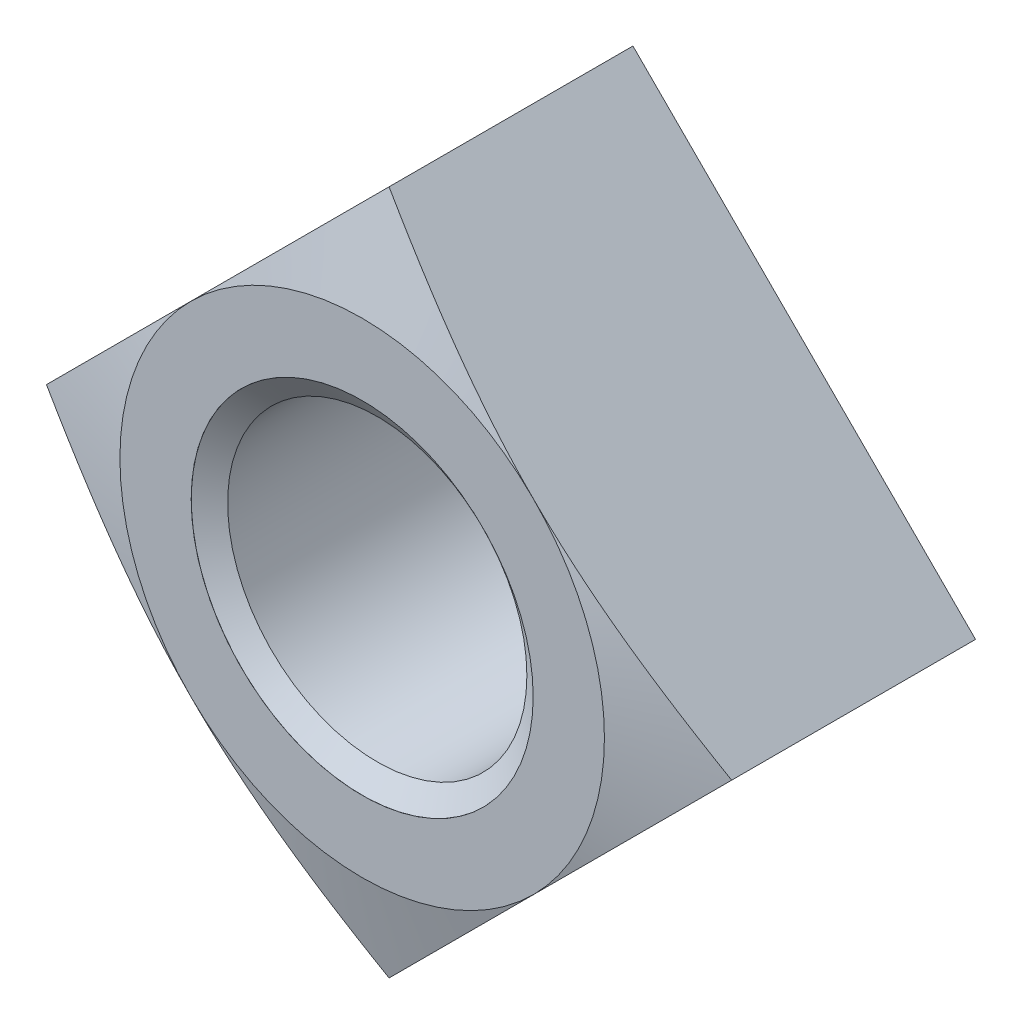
ISO-10303-21;
HEADER;
FILE_DESCRIPTION(('STEP AP214'),'2;1');
FILE_NAME('part.step','',(''),(''),'','','');
FILE_SCHEMA(('AUTOMOTIVE_DESIGN { 1 0 10303 214 1 1 1 1 }'));
ENDSEC;
DATA;
#1=APPLICATION_CONTEXT('core data for automotive mechanical design processes');
#2=APPLICATION_PROTOCOL_DEFINITION('international standard','automotive_design',2000,#1);
#3=PRODUCT_CONTEXT('',#1,'mechanical');
#4=PRODUCT('Part','Part','',(#3));
#5=PRODUCT_RELATED_PRODUCT_CATEGORY('part','',(#4));
#6=PRODUCT_DEFINITION_FORMATION('','',#4);
#7=PRODUCT_DEFINITION_CONTEXT('part definition',#1,'design');
#8=PRODUCT_DEFINITION('design','',#6,#7);
#9=PRODUCT_DEFINITION_SHAPE('','',#8);
#10=(LENGTH_UNIT() NAMED_UNIT(*) SI_UNIT(.MILLI.,.METRE.));
#11=(NAMED_UNIT(*) PLANE_ANGLE_UNIT() SI_UNIT($,.RADIAN.));
#12=(NAMED_UNIT(*) SI_UNIT($,.STERADIAN.) SOLID_ANGLE_UNIT());
#13=UNCERTAINTY_MEASURE_WITH_UNIT(LENGTH_MEASURE(1.E-05),#10,'distance_accuracy_value','');
#14=(GEOMETRIC_REPRESENTATION_CONTEXT(3) GLOBAL_UNCERTAINTY_ASSIGNED_CONTEXT((#13)) GLOBAL_UNIT_ASSIGNED_CONTEXT((#10,
#11,#12)) REPRESENTATION_CONTEXT('',''));
#15=CARTESIAN_POINT('',(0.,0.,0.));
#16=DIRECTION('',(0.,0.,1.));
#17=DIRECTION('',(1.,0.,0.));
#18=AXIS2_PLACEMENT_3D('',#15,#16,#17);
#19=CARTESIAN_POINT('',(0.,0.,-19.));
#20=DIRECTION('',(0.,0.,1.));
#21=DIRECTION('',(1.,0.,0.));
#22=AXIS2_PLACEMENT_3D('',#19,#20,#21);
#23=CYLINDRICAL_SURFACE('',#22,10.5);
#24=CARTESIAN_POINT('',(0.,0.,-1.05831130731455));
#25=DIRECTION('',(0.,0.,1.));
#26=DIRECTION('',(1.,0.,0.));
#27=AXIS2_PLACEMENT_3D('',#24,#25,#26);
#28=CIRCLE('',#27,10.5);
#29=CARTESIAN_POINT('',(10.5,0.,-1.05831130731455));
#30=VERTEX_POINT('',#29);
#31=EDGE_CURVE('E185',#30,#30,#28,.F.);
#32=ORIENTED_EDGE('',*,*,#31,.F.);
#33=EDGE_LOOP('',(#32));
#34=FACE_BOUND('',#33,.T.);
#35=CARTESIAN_POINT('',(0.,0.,-17.9406886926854));
#36=DIRECTION('',(0.,0.,-1.));
#37=DIRECTION('',(-1.,0.,0.));
#38=AXIS2_PLACEMENT_3D('',#35,#36,#37);
#39=CIRCLE('',#38,10.5);
#40=CARTESIAN_POINT('',(-10.5,0.,-17.9406886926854));
#41=VERTEX_POINT('',#40);
#42=EDGE_CURVE('E46',#41,#41,#39,.F.);
#43=ORIENTED_EDGE('',*,*,#42,.F.);
#44=EDGE_LOOP('',(#43));
#45=FACE_BOUND('',#44,.T.);
#46=ADVANCED_FACE('F41',(#34,#45),#23,.F.);
#47=CARTESIAN_POINT('',(0.,-24.0416305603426,-19.));
#48=DIRECTION('',(0.707106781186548,-0.707106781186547,0.));
#49=DIRECTION('',(0.707106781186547,0.707106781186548,0.));
#50=AXIS2_PLACEMENT_3D('',#47,#48,#49);
#51=PLANE('',#50);
#52=DIRECTION('',(0.,0.,1.));
#53=VECTOR('',#52,1.);
#54=CARTESIAN_POINT('',(24.0416305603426,0.,-19.));
#55=LINE('',#54,#53);
#56=CARTESIAN_POINT('',(24.0416305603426,0.,-19.));
#57=VERTEX_POINT('',#56);
#58=CARTESIAN_POINT('',(24.0416305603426,0.,-1.88679922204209));
#59=VERTEX_POINT('',#58);
#60=EDGE_CURVE('E172',#57,#59,#55,.T.);
#61=ORIENTED_EDGE('',*,*,#60,.T.);
#62=CARTESIAN_POINT('',(24.0418305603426,0.000200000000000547,-1.88685281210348));
#63=CARTESIAN_POINT('',(23.6810411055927,-0.360589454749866,-1.7901955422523));
#64=CARTESIAN_POINT('',(23.3199703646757,-0.721660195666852,-1.69560617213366));
#65=CARTESIAN_POINT('',(22.5971946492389,-1.44443591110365,-1.51127094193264));
#66=CARTESIAN_POINT('',(22.2354896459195,-1.80614091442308,-1.42152530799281));
#67=CARTESIAN_POINT('',(21.5111693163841,-2.5304612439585,-1.24753722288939));
#68=CARTESIAN_POINT('',(21.1485535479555,-2.89307701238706,-1.16329842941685));
#69=CARTESIAN_POINT('',(20.4226152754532,-3.61901528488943,-1.00123125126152));
#70=CARTESIAN_POINT('',(20.059292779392,-3.98233778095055,-0.92340279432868));
#71=CARTESIAN_POINT('',(18.9673670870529,-5.07426347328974,-0.700735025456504));
#72=CARTESIAN_POINT('',(18.2375962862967,-5.80403427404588,-0.566907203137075));
#73=CARTESIAN_POINT('',(17.1408011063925,-6.90082945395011,-0.394369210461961));
#74=CARTESIAN_POINT('',(16.7748732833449,-7.26675727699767,-0.341560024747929));
#75=CARTESIAN_POINT('',(16.0423433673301,-7.99928719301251,-0.24638041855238));
#76=CARTESIAN_POINT('',(15.6757412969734,-8.3658892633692,-0.204009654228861));
#77=CARTESIAN_POINT('',(14.9475096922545,-9.09412086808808,-0.131203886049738));
#78=CARTESIAN_POINT('',(14.5858887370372,-9.45574182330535,-0.100598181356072));
#79=CARTESIAN_POINT('',(13.8622417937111,-10.1793887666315,-0.0511623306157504));
#80=CARTESIAN_POINT('',(13.5002158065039,-10.5414147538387,-0.0323321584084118));
#81=CARTESIAN_POINT('',(12.7759417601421,-11.2656888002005,-0.00693322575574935));
#82=CARTESIAN_POINT('',(12.4136936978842,-11.6279368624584,-0.00036464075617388));
#83=CARTESIAN_POINT('',(11.68919235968,-12.3524382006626,0.000335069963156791));
#84=CARTESIAN_POINT('',(11.3269390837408,-12.7146914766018,-0.00553378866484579));
#85=CARTESIAN_POINT('',(10.6030026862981,-13.4386278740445,-0.0295412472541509));
#86=CARTESIAN_POINT('',(10.2413193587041,-13.8003112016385,-0.047667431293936));
#87=CARTESIAN_POINT('',(9.51835087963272,-14.5232796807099,-0.0957014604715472));
#88=CARTESIAN_POINT('',(9.15706573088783,-14.8845648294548,-0.12560938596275));
#89=CARTESIAN_POINT('',(8.07403908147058,-15.967591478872,-0.231960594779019));
#90=CARTESIAN_POINT('',(7.35308599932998,-16.6885445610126,-0.325032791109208));
#91=CARTESIAN_POINT('',(6.35641213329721,-17.6852184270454,-0.479473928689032));
#92=CARTESIAN_POINT('',(6.07939888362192,-17.9622316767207,-0.525167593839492));
#93=CARTESIAN_POINT('',(5.52582325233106,-18.5158073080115,-0.621550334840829));
#94=CARTESIAN_POINT('',(5.24926083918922,-18.7923697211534,-0.672239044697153));
#95=CARTESIAN_POINT('',(4.42016185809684,-19.6214687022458,-0.831140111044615));
#96=CARTESIAN_POINT('',(3.8682783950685,-20.1733521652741,-0.94617714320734));
#97=CARTESIAN_POINT('',(2.76265174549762,-21.278978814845,-1.19188048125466));
#98=CARTESIAN_POINT('',(2.20891926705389,-21.8327112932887,-1.32264211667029));
#99=CARTESIAN_POINT('',(1.37955839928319,-22.6620721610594,-1.52787262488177));
#100=CARTESIAN_POINT('',(1.1033603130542,-22.9382702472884,-1.59778417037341));
#101=CARTESIAN_POINT('',(0.551320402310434,-23.4903101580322,-1.74034210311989));
#102=CARTESIAN_POINT('',(0.275478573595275,-23.7661519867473,-1.81298845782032));
#103=CARTESIAN_POINT('',(-0.000200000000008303,-24.0418305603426,-1.88685281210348));
#104=B_SPLINE_CURVE_WITH_KNOTS('',3,(#62,#63,#64,#65,#66,#67,#68,#69,#70,#71,#72,#73,#74,#75,
#76,#77,#78,#79,#80,#81,#82,#83,#84,#85,#86,#87,#88,#89,#90,#91,#92,#93,#94,#95,#96,#97,#98,#99,
#100,#101,#102,#103),.UNSPECIFIED.,.F.,.F.,(4,2,2,2,2,2,2,2,2,2,2,2,2,2,2,2,2,2,2,2,4),(0.,
1.55792765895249,3.11592799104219,4.67495286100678,6.23396015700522,9.35537810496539,
10.9158569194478,12.4762843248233,14.0131299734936,15.5499722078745,17.0868364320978,
18.6236987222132,20.159006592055,21.6943249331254,24.7647903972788,25.948012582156,
27.1311481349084,29.4976960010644,31.8793921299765,33.0698149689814,34.2602236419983),.UNSPECIFIED.);
#105=CARTESIAN_POINT('',(12.0208152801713,-12.0208152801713,0.));
#106=VERTEX_POINT('',#105);
#107=EDGE_CURVE('E162',#59,#106,#104,.T.);
#108=ORIENTED_EDGE('',*,*,#107,.T.);
#109=CARTESIAN_POINT('',(0.,-24.0416305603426,-1.88679922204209));
#110=VERTEX_POINT('',#109);
#111=EDGE_CURVE('E69',#106,#110,#104,.T.);
#112=ORIENTED_EDGE('',*,*,#111,.T.);
#113=DIRECTION('',(0.,0.,1.));
#114=VECTOR('',#113,1.);
#115=CARTESIAN_POINT('',(0.,-24.0416305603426,-19.));
#116=LINE('',#115,#114);
#117=CARTESIAN_POINT('',(0.,-24.0416305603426,-19.));
#118=VERTEX_POINT('',#117);
#119=EDGE_CURVE('E117',#118,#110,#116,.T.);
#120=ORIENTED_EDGE('',*,*,#119,.F.);
#121=DIRECTION('',(0.707106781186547,0.707106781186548,0.));
#122=VECTOR('',#121,1.);
#123=CARTESIAN_POINT('',(0.,-24.0416305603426,-19.));
#124=LINE('',#123,#122);
#125=EDGE_CURVE('E161',#118,#57,#124,.T.);
#126=ORIENTED_EDGE('',*,*,#125,.T.);
#127=EDGE_LOOP('',(#61,#108,#112,#120,#126));
#128=FACE_BOUND('',#127,.T.);
#129=ADVANCED_FACE('F43',(#128),#51,.T.);
#130=CARTESIAN_POINT('',(-24.0416305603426,0.,-19.));
#131=DIRECTION('',(-0.707106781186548,-0.707106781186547,0.));
#132=DIRECTION('',(0.707106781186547,-0.707106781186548,0.));
#133=AXIS2_PLACEMENT_3D('',#130,#131,#132);
#134=PLANE('',#133);
#135=ORIENTED_EDGE('',*,*,#119,.T.);
#136=CARTESIAN_POINT('',(0.00019999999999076,-24.0418305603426,-1.88685281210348));
#137=CARTESIAN_POINT('',(-0.360589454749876,-23.6810411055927,-1.79019554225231));
#138=CARTESIAN_POINT('',(-0.721660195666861,-23.3199703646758,-1.69560617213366));
#139=CARTESIAN_POINT('',(-1.44443591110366,-22.597194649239,-1.51127094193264));
#140=CARTESIAN_POINT('',(-1.80614091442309,-22.2354896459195,-1.42152530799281));
#141=CARTESIAN_POINT('',(-2.53046124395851,-21.5111693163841,-1.24753722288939));
#142=CARTESIAN_POINT('',(-2.89307701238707,-21.1485535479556,-1.16329842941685));
#143=CARTESIAN_POINT('',(-3.61901528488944,-20.4226152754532,-1.00123125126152));
#144=CARTESIAN_POINT('',(-3.98233778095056,-20.0592927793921,-0.923402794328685));
#145=CARTESIAN_POINT('',(-5.07426347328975,-18.9673670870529,-0.700735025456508));
#146=CARTESIAN_POINT('',(-5.80403427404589,-18.2375962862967,-0.566907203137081));
#147=CARTESIAN_POINT('',(-6.90082945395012,-17.1408011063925,-0.394369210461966));
#148=CARTESIAN_POINT('',(-7.26675727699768,-16.7748732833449,-0.341560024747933));
#149=CARTESIAN_POINT('',(-7.99928719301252,-16.0423433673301,-0.246380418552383));
#150=CARTESIAN_POINT('',(-8.36588926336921,-15.6757412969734,-0.204009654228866));
#151=CARTESIAN_POINT('',(-9.09412086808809,-14.9475096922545,-0.131203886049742));
#152=CARTESIAN_POINT('',(-9.45574182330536,-14.5858887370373,-0.100598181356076));
#153=CARTESIAN_POINT('',(-10.1793887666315,-13.8622417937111,-0.0511623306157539));
#154=CARTESIAN_POINT('',(-10.5414147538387,-13.5002158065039,-0.0323321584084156));
#155=CARTESIAN_POINT('',(-11.2656888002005,-12.7759417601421,-0.00693322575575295));
#156=CARTESIAN_POINT('',(-11.6279368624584,-12.4136936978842,-0.000364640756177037));
#157=CARTESIAN_POINT('',(-12.3524382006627,-11.68919235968,0.000335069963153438));
#158=CARTESIAN_POINT('',(-12.7146914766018,-11.3269390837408,-0.00553378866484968));
#159=CARTESIAN_POINT('',(-13.4386278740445,-10.6030026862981,-0.0295412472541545));
#160=CARTESIAN_POINT('',(-13.8003112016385,-10.2413193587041,-0.0476674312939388));
#161=CARTESIAN_POINT('',(-14.5232796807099,-9.51835087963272,-0.0957014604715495));
#162=CARTESIAN_POINT('',(-14.8845648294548,-9.15706573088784,-0.125609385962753));
#163=CARTESIAN_POINT('',(-15.967591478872,-8.07403908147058,-0.231960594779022));
#164=CARTESIAN_POINT('',(-16.6885445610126,-7.35308599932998,-0.325032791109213));
#165=CARTESIAN_POINT('',(-17.6852184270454,-6.3564121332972,-0.479473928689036));
#166=CARTESIAN_POINT('',(-17.9622316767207,-6.07939888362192,-0.525167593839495));
#167=CARTESIAN_POINT('',(-18.5158073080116,-5.52582325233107,-0.621550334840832));
#168=CARTESIAN_POINT('',(-18.7923697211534,-5.24926083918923,-0.672239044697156));
#169=CARTESIAN_POINT('',(-19.6214687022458,-4.42016185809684,-0.831140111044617));
#170=CARTESIAN_POINT('',(-20.1733521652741,-3.8682783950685,-0.946177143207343));
#171=CARTESIAN_POINT('',(-21.278978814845,-2.76265174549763,-1.19188048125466));
#172=CARTESIAN_POINT('',(-21.8327112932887,-2.20891926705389,-1.32264211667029));
#173=CARTESIAN_POINT('',(-22.6620721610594,-1.3795583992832,-1.52787262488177));
#174=CARTESIAN_POINT('',(-22.9382702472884,-1.1033603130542,-1.59778417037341));
#175=CARTESIAN_POINT('',(-23.4903101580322,-0.551320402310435,-1.74034210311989));
#176=CARTESIAN_POINT('',(-23.7661519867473,-0.275478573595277,-1.81298845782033));
#177=CARTESIAN_POINT('',(-24.0418305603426,0.000200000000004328,-1.88685281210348));
#178=B_SPLINE_CURVE_WITH_KNOTS('',3,(#136,#137,#138,#139,#140,#141,#142,#143,#144,#145,#146,
#147,#148,#149,#150,#151,#152,#153,#154,#155,#156,#157,#158,#159,#160,#161,#162,#163,#164,#165,
#166,#167,#168,#169,#170,#171,#172,#173,#174,#175,#176,#177),.UNSPECIFIED.,.F.,.F.,(4,2,2,2,2,2,
2,2,2,2,2,2,2,2,2,2,2,2,2,2,4),(0.,1.55792765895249,3.11592799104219,4.67495286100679,
6.23396015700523,9.3553781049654,10.9158569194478,12.4762843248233,14.0131299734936,
15.5499722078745,17.0868364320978,18.6236987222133,20.159006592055,21.6943249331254,
24.7647903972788,25.948012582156,27.1311481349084,29.4976960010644,31.8793921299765,
33.0698149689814,34.2602236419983),.UNSPECIFIED.);
#179=CARTESIAN_POINT('',(-12.0208152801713,-12.0208152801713,0.));
#180=VERTEX_POINT('',#179);
#181=EDGE_CURVE('E128',#110,#180,#178,.T.);
#182=ORIENTED_EDGE('',*,*,#181,.T.);
#183=CARTESIAN_POINT('',(-24.0416305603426,0.,-1.8867992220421));
#184=VERTEX_POINT('',#183);
#185=EDGE_CURVE('E112',#180,#184,#178,.T.);
#186=ORIENTED_EDGE('',*,*,#185,.T.);
#187=DIRECTION('',(0.,0.,1.));
#188=VECTOR('',#187,1.);
#189=CARTESIAN_POINT('',(-24.0416305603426,0.,-19.));
#190=LINE('',#189,#188);
#191=CARTESIAN_POINT('',(-24.0416305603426,0.,-19.));
#192=VERTEX_POINT('',#191);
#193=EDGE_CURVE('E123',#192,#184,#190,.T.);
#194=ORIENTED_EDGE('',*,*,#193,.F.);
#195=DIRECTION('',(0.707106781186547,-0.707106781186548,0.));
#196=VECTOR('',#195,1.);
#197=CARTESIAN_POINT('',(-24.0416305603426,0.,-19.));
#198=LINE('',#197,#196);
#199=EDGE_CURVE('E171',#192,#118,#198,.T.);
#200=ORIENTED_EDGE('',*,*,#199,.T.);
#201=EDGE_LOOP('',(#135,#182,#186,#194,#200));
#202=FACE_BOUND('',#201,.T.);
#203=ADVANCED_FACE('F224',(#202),#134,.T.);
#204=CARTESIAN_POINT('',(0.,24.0416305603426,-19.));
#205=DIRECTION('',(-0.707106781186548,0.707106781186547,0.));
#206=DIRECTION('',(-0.707106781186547,-0.707106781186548,0.));
#207=AXIS2_PLACEMENT_3D('',#204,#205,#206);
#208=PLANE('',#207);
#209=ORIENTED_EDGE('',*,*,#193,.T.);
#210=CARTESIAN_POINT('',(-24.0418305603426,-0.000199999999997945,-1.88685281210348));
#211=CARTESIAN_POINT('',(-23.6810411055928,0.36058945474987,-1.7901955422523));
#212=CARTESIAN_POINT('',(-23.3199703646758,0.721660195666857,-1.69560617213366));
#213=CARTESIAN_POINT('',(-22.597194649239,1.44443591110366,-1.51127094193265));
#214=CARTESIAN_POINT('',(-22.2354896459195,1.80614091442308,-1.42152530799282));
#215=CARTESIAN_POINT('',(-21.5111693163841,2.53046124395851,-1.24753722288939));
#216=CARTESIAN_POINT('',(-21.1485535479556,2.89307701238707,-1.16329842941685));
#217=CARTESIAN_POINT('',(-20.4226152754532,3.61901528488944,-1.00123125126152));
#218=CARTESIAN_POINT('',(-20.0592927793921,3.98233778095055,-0.923402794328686));
#219=CARTESIAN_POINT('',(-18.9673670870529,5.07426347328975,-0.70073502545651));
#220=CARTESIAN_POINT('',(-18.2375962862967,5.80403427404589,-0.566907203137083));
#221=CARTESIAN_POINT('',(-17.1408011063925,6.90082945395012,-0.394369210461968));
#222=CARTESIAN_POINT('',(-16.774873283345,7.26675727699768,-0.341560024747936));
#223=CARTESIAN_POINT('',(-16.0423433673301,7.99928719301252,-0.246380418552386));
#224=CARTESIAN_POINT('',(-15.6757412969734,8.3658892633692,-0.204009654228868));
#225=CARTESIAN_POINT('',(-14.9475096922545,9.09412086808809,-0.131203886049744));
#226=CARTESIAN_POINT('',(-14.5858887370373,9.45574182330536,-0.100598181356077));
#227=CARTESIAN_POINT('',(-13.8622417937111,10.1793887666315,-0.0511623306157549));
#228=CARTESIAN_POINT('',(-13.5002158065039,10.5414147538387,-0.0323321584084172));
#229=CARTESIAN_POINT('',(-12.7759417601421,11.2656888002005,-0.00693322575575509));
#230=CARTESIAN_POINT('',(-12.4136936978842,11.6279368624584,-0.000364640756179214));
#231=CARTESIAN_POINT('',(-11.68919235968,12.3524382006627,0.000335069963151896));
#232=CARTESIAN_POINT('',(-11.3269390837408,12.7146914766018,-0.00553378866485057));
#233=CARTESIAN_POINT('',(-10.6030026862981,13.4386278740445,-0.0295412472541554));
#234=CARTESIAN_POINT('',(-10.2413193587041,13.8003112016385,-0.0476674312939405));
#235=CARTESIAN_POINT('',(-9.51835087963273,14.5232796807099,-0.0957014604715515));
#236=CARTESIAN_POINT('',(-9.15706573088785,14.8845648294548,-0.125609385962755));
#237=CARTESIAN_POINT('',(-8.07403908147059,15.967591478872,-0.231960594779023));
#238=CARTESIAN_POINT('',(-7.35308599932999,16.6885445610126,-0.325032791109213));
#239=CARTESIAN_POINT('',(-6.35641213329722,17.6852184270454,-0.479473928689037));
#240=CARTESIAN_POINT('',(-6.07939888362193,17.9622316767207,-0.525167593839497));
#241=CARTESIAN_POINT('',(-5.52582325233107,18.5158073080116,-0.621550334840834));
#242=CARTESIAN_POINT('',(-5.24926083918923,18.7923697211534,-0.672239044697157));
#243=CARTESIAN_POINT('',(-4.42016185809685,19.6214687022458,-0.831140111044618));
#244=CARTESIAN_POINT('',(-3.86827839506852,20.1733521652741,-0.946177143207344));
#245=CARTESIAN_POINT('',(-2.76265174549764,21.278978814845,-1.19188048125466));
#246=CARTESIAN_POINT('',(-2.2089192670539,21.8327112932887,-1.3226421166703));
#247=CARTESIAN_POINT('',(-1.37955839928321,22.6620721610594,-1.52787262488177));
#248=CARTESIAN_POINT('',(-1.10336031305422,22.9382702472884,-1.59778417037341));
#249=CARTESIAN_POINT('',(-0.551320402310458,23.4903101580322,-1.74034210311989));
#250=CARTESIAN_POINT('',(-0.275478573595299,23.7661519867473,-1.81298845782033));
#251=CARTESIAN_POINT('',(0.000199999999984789,24.0418305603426,-1.88685281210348));
#252=B_SPLINE_CURVE_WITH_KNOTS('',3,(#210,#211,#212,#213,#214,#215,#216,#217,#218,#219,#220,
#221,#222,#223,#224,#225,#226,#227,#228,#229,#230,#231,#232,#233,#234,#235,#236,#237,#238,#239,
#240,#241,#242,#243,#244,#245,#246,#247,#248,#249,#250,#251),.UNSPECIFIED.,.F.,.F.,(4,2,2,2,2,2,
2,2,2,2,2,2,2,2,2,2,2,2,2,2,4),(0.,1.55792765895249,3.11592799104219,4.67495286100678,
6.23396015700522,9.35537810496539,10.9158569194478,12.4762843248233,14.0131299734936,
15.5499722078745,17.0868364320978,18.6236987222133,20.159006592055,21.6943249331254,
24.7647903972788,25.948012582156,27.1311481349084,29.4976960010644,31.8793921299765,
33.0698149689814,34.2602236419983),.UNSPECIFIED.);
#253=CARTESIAN_POINT('',(-12.0208152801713,12.0208152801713,0.));
#254=VERTEX_POINT('',#253);
#255=EDGE_CURVE('E110',#184,#254,#252,.T.);
#256=ORIENTED_EDGE('',*,*,#255,.T.);
#257=CARTESIAN_POINT('',(0.,24.0416305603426,-1.8867992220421));
#258=VERTEX_POINT('',#257);
#259=EDGE_CURVE('E98',#254,#258,#252,.T.);
#260=ORIENTED_EDGE('',*,*,#259,.T.);
#261=DIRECTION('',(0.,0.,1.));
#262=VECTOR('',#261,1.);
#263=CARTESIAN_POINT('',(0.,24.0416305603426,-19.));
#264=LINE('',#263,#262);
#265=CARTESIAN_POINT('',(0.,24.0416305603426,-19.));
#266=VERTEX_POINT('',#265);
#267=EDGE_CURVE('E178',#266,#258,#264,.T.);
#268=ORIENTED_EDGE('',*,*,#267,.F.);
#269=DIRECTION('',(-0.707106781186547,-0.707106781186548,0.));
#270=VECTOR('',#269,1.);
#271=CARTESIAN_POINT('',(0.,24.0416305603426,-19.));
#272=LINE('',#271,#270);
#273=EDGE_CURVE('E169',#266,#192,#272,.T.);
#274=ORIENTED_EDGE('',*,*,#273,.T.);
#275=EDGE_LOOP('',(#209,#256,#260,#268,#274));
#276=FACE_BOUND('',#275,.T.);
#277=ADVANCED_FACE('F124',(#276),#208,.T.);
#278=CARTESIAN_POINT('',(24.0416305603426,0.,-19.));
#279=DIRECTION('',(0.707106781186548,0.707106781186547,0.));
#280=DIRECTION('',(-0.707106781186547,0.707106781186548,0.));
#281=AXIS2_PLACEMENT_3D('',#278,#279,#280);
#282=PLANE('',#281);
#283=ORIENTED_EDGE('',*,*,#267,.T.);
#284=CARTESIAN_POINT('',(-0.00020000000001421,24.0418305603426,-1.88685281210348));
#285=CARTESIAN_POINT('',(0.360589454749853,23.6810411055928,-1.79019554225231));
#286=CARTESIAN_POINT('',(0.721660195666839,23.3199703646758,-1.69560617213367));
#287=CARTESIAN_POINT('',(1.44443591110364,22.597194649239,-1.51127094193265));
#288=CARTESIAN_POINT('',(1.80614091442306,22.2354896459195,-1.42152530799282));
#289=CARTESIAN_POINT('',(2.53046124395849,21.5111693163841,-1.24753722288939));
#290=CARTESIAN_POINT('',(2.89307701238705,21.1485535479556,-1.16329842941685));
#291=CARTESIAN_POINT('',(3.61901528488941,20.4226152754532,-1.00123125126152));
#292=CARTESIAN_POINT('',(3.98233778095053,20.0592927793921,-0.923402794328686));
#293=CARTESIAN_POINT('',(5.07426347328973,18.9673670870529,-0.700735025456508));
#294=CARTESIAN_POINT('',(5.80403427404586,18.2375962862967,-0.566907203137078));
#295=CARTESIAN_POINT('',(6.9008294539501,17.1408011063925,-0.394369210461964));
#296=CARTESIAN_POINT('',(7.26675727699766,16.7748732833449,-0.341560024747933));
#297=CARTESIAN_POINT('',(7.9992871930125,16.0423433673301,-0.246380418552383));
#298=CARTESIAN_POINT('',(8.36588926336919,15.6757412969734,-0.204009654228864));
#299=CARTESIAN_POINT('',(9.09412086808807,14.9475096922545,-0.13120388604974));
#300=CARTESIAN_POINT('',(9.45574182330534,14.5858887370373,-0.100598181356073));
#301=CARTESIAN_POINT('',(10.1793887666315,13.8622417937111,-0.0511623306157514));
#302=CARTESIAN_POINT('',(10.5414147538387,13.5002158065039,-0.0323321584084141));
#303=CARTESIAN_POINT('',(11.2656888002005,12.7759417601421,-0.00693322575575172));
#304=CARTESIAN_POINT('',(11.6279368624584,12.4136936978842,-0.000364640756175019));
#305=CARTESIAN_POINT('',(12.3524382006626,11.68919235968,0.000335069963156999));
#306=CARTESIAN_POINT('',(12.7146914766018,11.3269390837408,-0.00553378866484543));
#307=CARTESIAN_POINT('',(13.4386278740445,10.6030026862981,-0.0295412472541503));
#308=CARTESIAN_POINT('',(13.8003112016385,10.2413193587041,-0.0476674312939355));
#309=CARTESIAN_POINT('',(14.5232796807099,9.51835087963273,-0.0957014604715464));
#310=CARTESIAN_POINT('',(14.8845648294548,9.15706573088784,-0.125609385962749));
#311=CARTESIAN_POINT('',(15.967591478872,8.07403908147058,-0.231960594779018));
#312=CARTESIAN_POINT('',(16.6885445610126,7.35308599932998,-0.325032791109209));
#313=CARTESIAN_POINT('',(17.6852184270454,6.35641213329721,-0.479473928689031));
#314=CARTESIAN_POINT('',(17.9622316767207,6.07939888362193,-0.52516759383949));
#315=CARTESIAN_POINT('',(18.5158073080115,5.52582325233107,-0.621550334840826));
#316=CARTESIAN_POINT('',(18.7923697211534,5.24926083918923,-0.67223904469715));
#317=CARTESIAN_POINT('',(19.6214687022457,4.42016185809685,-0.831140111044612));
#318=CARTESIAN_POINT('',(20.1733521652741,3.86827839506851,-0.946177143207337));
#319=CARTESIAN_POINT('',(21.278978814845,2.76265174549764,-1.19188048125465));
#320=CARTESIAN_POINT('',(21.8327112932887,2.2089192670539,-1.32264211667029));
#321=CARTESIAN_POINT('',(22.6620721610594,1.37955839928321,-1.52787262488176));
#322=CARTESIAN_POINT('',(22.9382702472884,1.10336031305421,-1.5977841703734));
#323=CARTESIAN_POINT('',(23.4903101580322,0.55132040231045,-1.74034210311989));
#324=CARTESIAN_POINT('',(23.7661519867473,0.27547857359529,-1.81298845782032));
#325=CARTESIAN_POINT('',(24.0418305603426,-0.000199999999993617,-1.88685281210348));
#326=B_SPLINE_CURVE_WITH_KNOTS('',3,(#284,#285,#286,#287,#288,#289,#290,#291,#292,#293,#294,
#295,#296,#297,#298,#299,#300,#301,#302,#303,#304,#305,#306,#307,#308,#309,#310,#311,#312,#313,
#314,#315,#316,#317,#318,#319,#320,#321,#322,#323,#324,#325),.UNSPECIFIED.,.F.,.F.,(4,2,2,2,2,2,
2,2,2,2,2,2,2,2,2,2,2,2,2,2,4),(0.,1.55792765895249,3.11592799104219,4.67495286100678,
6.23396015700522,9.3553781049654,10.9158569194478,12.4762843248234,14.0131299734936,
15.5499722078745,17.0868364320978,18.6236987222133,20.159006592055,21.6943249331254,
24.7647903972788,25.948012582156,27.1311481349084,29.4976960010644,31.8793921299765,
33.0698149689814,34.2602236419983),.UNSPECIFIED.);
#327=CARTESIAN_POINT('',(12.0208152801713,12.0208152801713,0.));
#328=VERTEX_POINT('',#327);
#329=EDGE_CURVE('E101',#258,#328,#326,.T.);
#330=ORIENTED_EDGE('',*,*,#329,.T.);
#331=EDGE_CURVE('E56',#328,#59,#326,.T.);
#332=ORIENTED_EDGE('',*,*,#331,.T.);
#333=ORIENTED_EDGE('',*,*,#60,.F.);
#334=DIRECTION('',(-0.707106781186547,0.707106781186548,0.));
#335=VECTOR('',#334,1.);
#336=CARTESIAN_POINT('',(24.0416305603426,0.,-19.));
#337=LINE('',#336,#335);
#338=EDGE_CURVE('E168',#57,#266,#337,.T.);
#339=ORIENTED_EDGE('',*,*,#338,.T.);
#340=EDGE_LOOP('',(#283,#330,#332,#333,#339));
#341=FACE_BOUND('',#340,.T.);
#342=ADVANCED_FACE('F208',(#341),#282,.T.);
#343=CARTESIAN_POINT('',(0.,-24.0416305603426,0.));
#344=DIRECTION('',(0.,0.,-1.));
#345=DIRECTION('',(-1.,0.,0.));
#346=AXIS2_PLACEMENT_3D('',#343,#344,#345);
#347=PLANE('',#346);
#348=CARTESIAN_POINT('',(0.,0.,0.));
#349=DIRECTION('',(0.,0.,-1.));
#350=DIRECTION('',(-1.,0.,0.));
#351=AXIS2_PLACEMENT_3D('',#348,#349,#350);
#352=CIRCLE('',#351,12.);
#353=CARTESIAN_POINT('',(-12.,0.,0.));
#354=VERTEX_POINT('',#353);
#355=EDGE_CURVE('E119',#354,#354,#352,.F.);
#356=ORIENTED_EDGE('',*,*,#355,.F.);
#357=EDGE_LOOP('',(#356));
#358=FACE_BOUND('',#357,.T.);
#359=CARTESIAN_POINT('',(0.,0.,0.));
#360=DIRECTION('',(0.,0.,1.));
#361=DIRECTION('',(1.,0.,0.));
#362=AXIS2_PLACEMENT_3D('',#359,#360,#361);
#363=CIRCLE('',#362,17.);
#364=EDGE_CURVE('E99',#328,#254,#363,.T.);
#365=ORIENTED_EDGE('',*,*,#364,.T.);
#366=CARTESIAN_POINT('',(0.,0.,0.));
#367=DIRECTION('',(0.,0.,-1.));
#368=DIRECTION('',(-1.,0.,0.));
#369=AXIS2_PLACEMENT_3D('',#366,#367,#368);
#370=CIRCLE('',#369,17.);
#371=EDGE_CURVE('E52',#180,#254,#370,.T.);
#372=ORIENTED_EDGE('',*,*,#371,.F.);
#373=EDGE_CURVE('E51',#106,#180,#370,.T.);
#374=ORIENTED_EDGE('',*,*,#373,.F.);
#375=EDGE_CURVE('E11',#328,#106,#370,.T.);
#376=ORIENTED_EDGE('',*,*,#375,.F.);
#377=EDGE_LOOP('',(#365,#372,#374,#376));
#378=FACE_BOUND('',#377,.T.);
#379=ADVANCED_FACE('F118',(#358,#378),#347,.F.);
#380=CARTESIAN_POINT('',(0.,-24.0416305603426,-19.));
#381=DIRECTION('',(0.,0.,-1.));
#382=DIRECTION('',(-1.,0.,0.));
#383=AXIS2_PLACEMENT_3D('',#380,#381,#382);
#384=PLANE('',#383);
#385=CARTESIAN_POINT('',(0.,0.,-19.));
#386=DIRECTION('',(0.,0.,-1.));
#387=DIRECTION('',(-1.,0.,0.));
#388=AXIS2_PLACEMENT_3D('',#385,#386,#387);
#389=CIRCLE('',#388,12.);
#390=CARTESIAN_POINT('',(-12.,0.,-19.));
#391=VERTEX_POINT('',#390);
#392=EDGE_CURVE('E190',#391,#391,#389,.F.);
#393=ORIENTED_EDGE('',*,*,#392,.T.);
#394=EDGE_LOOP('',(#393));
#395=FACE_BOUND('',#394,.T.);
#396=ORIENTED_EDGE('',*,*,#125,.F.);
#397=ORIENTED_EDGE('',*,*,#199,.F.);
#398=ORIENTED_EDGE('',*,*,#273,.F.);
#399=ORIENTED_EDGE('',*,*,#338,.F.);
#400=EDGE_LOOP('',(#396,#397,#398,#399));
#401=FACE_BOUND('',#400,.T.);
#402=ADVANCED_FACE('F209',(#395,#401),#384,.T.);
#403=CARTESIAN_POINT('',(0.,0.,0.));
#404=DIRECTION('',(0.,0.,-1.));
#405=DIRECTION('',(-1.,0.,0.));
#406=AXIS2_PLACEMENT_3D('',#403,#404,#405);
#407=CONICAL_SURFACE('',#406,17.,1.30899693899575);
#408=ORIENTED_EDGE('',*,*,#371,.T.);
#409=ORIENTED_EDGE('',*,*,#255,.F.);
#410=ORIENTED_EDGE('',*,*,#185,.F.);
#411=EDGE_LOOP('',(#408,#409,#410));
#412=FACE_BOUND('',#411,.T.);
#413=ADVANCED_FACE('F115',(#412),#407,.T.);
#414=ORIENTED_EDGE('',*,*,#373,.T.);
#415=ORIENTED_EDGE('',*,*,#181,.F.);
#416=ORIENTED_EDGE('',*,*,#111,.F.);
#417=EDGE_LOOP('',(#414,#415,#416));
#418=FACE_BOUND('',#417,.T.);
#419=ADVANCED_FACE('F291',(#418),#407,.T.);
#420=ORIENTED_EDGE('',*,*,#331,.F.);
#421=ORIENTED_EDGE('',*,*,#375,.T.);
#422=ORIENTED_EDGE('',*,*,#107,.F.);
#423=EDGE_LOOP('',(#420,#421,#422));
#424=FACE_BOUND('',#423,.T.);
#425=ADVANCED_FACE('F153',(#424),#407,.T.);
#426=ORIENTED_EDGE('',*,*,#364,.F.);
#427=ORIENTED_EDGE('',*,*,#329,.F.);
#428=ORIENTED_EDGE('',*,*,#259,.F.);
#429=EDGE_LOOP('',(#426,#427,#428));
#430=FACE_BOUND('',#429,.T.);
#431=ADVANCED_FACE('F96',(#430),#407,.T.);
#432=CARTESIAN_POINT('',(0.,0.,-25.0375057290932));
#433=DIRECTION('',(0.,0.,1.));
#434=DIRECTION('',(1.,0.,0.));
#435=AXIS2_PLACEMENT_3D('',#432,#433,#434);
#436=CYLINDRICAL_SURFACE('',#435,12.);
#437=CARTESIAN_POINT('',(0.,0.,-0.00799999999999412));
#438=DIRECTION('',(0.,0.,1.));
#439=DIRECTION('',(1.,0.,0.));
#440=AXIS2_PLACEMENT_3D('',#437,#438,#439);
#441=CIRCLE('',#440,12.);
#442=CARTESIAN_POINT('',(12.,0.,-0.00799999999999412));
#443=VERTEX_POINT('',#442);
#444=EDGE_CURVE('E184',#443,#443,#441,.T.);
#445=ORIENTED_EDGE('',*,*,#444,.F.);
#446=EDGE_LOOP('',(#445));
#447=FACE_BOUND('',#446,.T.);
#448=ORIENTED_EDGE('',*,*,#355,.T.);
#449=EDGE_LOOP('',(#448));
#450=FACE_BOUND('',#449,.T.);
#451=ADVANCED_FACE('F146',(#447,#450),#436,.F.);
#452=CARTESIAN_POINT('',(0.,0.,-1.16334243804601));
#453=DIRECTION('',(0.,0.,1.));
#454=DIRECTION('',(1.,0.,0.));
#455=AXIS2_PLACEMENT_3D('',#452,#453,#454);
#456=CONICAL_SURFACE('',#455,10.35,0.959931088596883);
#457=ORIENTED_EDGE('',*,*,#444,.T.);
#458=EDGE_LOOP('',(#457));
#459=FACE_BOUND('',#458,.T.);
#460=ORIENTED_EDGE('',*,*,#31,.T.);
#461=EDGE_LOOP('',(#460));
#462=FACE_BOUND('',#461,.T.);
#463=ADVANCED_FACE('F203',(#459,#462),#456,.F.);
#464=CARTESIAN_POINT('',(0.,0.,-18.991));
#465=DIRECTION('',(0.,0.,-1.));
#466=DIRECTION('',(-1.,0.,0.));
#467=AXIS2_PLACEMENT_3D('',#464,#465,#466);
#468=CONICAL_SURFACE('',#467,12.,0.959931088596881);
#469=CARTESIAN_POINT('',(0.,0.,-18.991));
#470=DIRECTION('',(0.,0.,1.));
#471=DIRECTION('',(1.,0.,0.));
#472=AXIS2_PLACEMENT_3D('',#469,#470,#471);
#473=CIRCLE('',#472,12.);
#474=CARTESIAN_POINT('',(12.,0.,-18.991));
#475=VERTEX_POINT('',#474);
#476=EDGE_CURVE('E186',#475,#475,#473,.T.);
#477=ORIENTED_EDGE('',*,*,#476,.F.);
#478=EDGE_LOOP('',(#477));
#479=FACE_BOUND('',#478,.T.);
#480=ORIENTED_EDGE('',*,*,#42,.T.);
#481=EDGE_LOOP('',(#480));
#482=FACE_BOUND('',#481,.T.);
#483=ADVANCED_FACE('F226',(#479,#482),#468,.F.);
#484=CARTESIAN_POINT('',(0.,0.,-25.0375057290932));
#485=DIRECTION('',(0.,0.,1.));
#486=DIRECTION('',(1.,0.,0.));
#487=AXIS2_PLACEMENT_3D('',#484,#485,#486);
#488=CYLINDRICAL_SURFACE('',#487,12.);
#489=ORIENTED_EDGE('',*,*,#392,.F.);
#490=EDGE_LOOP('',(#489));
#491=FACE_BOUND('',#490,.T.);
#492=ORIENTED_EDGE('',*,*,#476,.T.);
#493=EDGE_LOOP('',(#492));
#494=FACE_BOUND('',#493,.T.);
#495=ADVANCED_FACE('F229',(#491,#494),#488,.F.);
#496=CLOSED_SHELL('',(#46,#129,#203,#277,#342,#379,#402,#413,#419,#425,#431,#451,#463,#483,#495));
#497=MANIFOLD_SOLID_BREP('B2',#496);
#498=ADVANCED_BREP_SHAPE_REPRESENTATION('',(#18,#497),#14);
#499=SHAPE_DEFINITION_REPRESENTATION(#9,#498);
ENDSEC;
END-ISO-10303-21;
